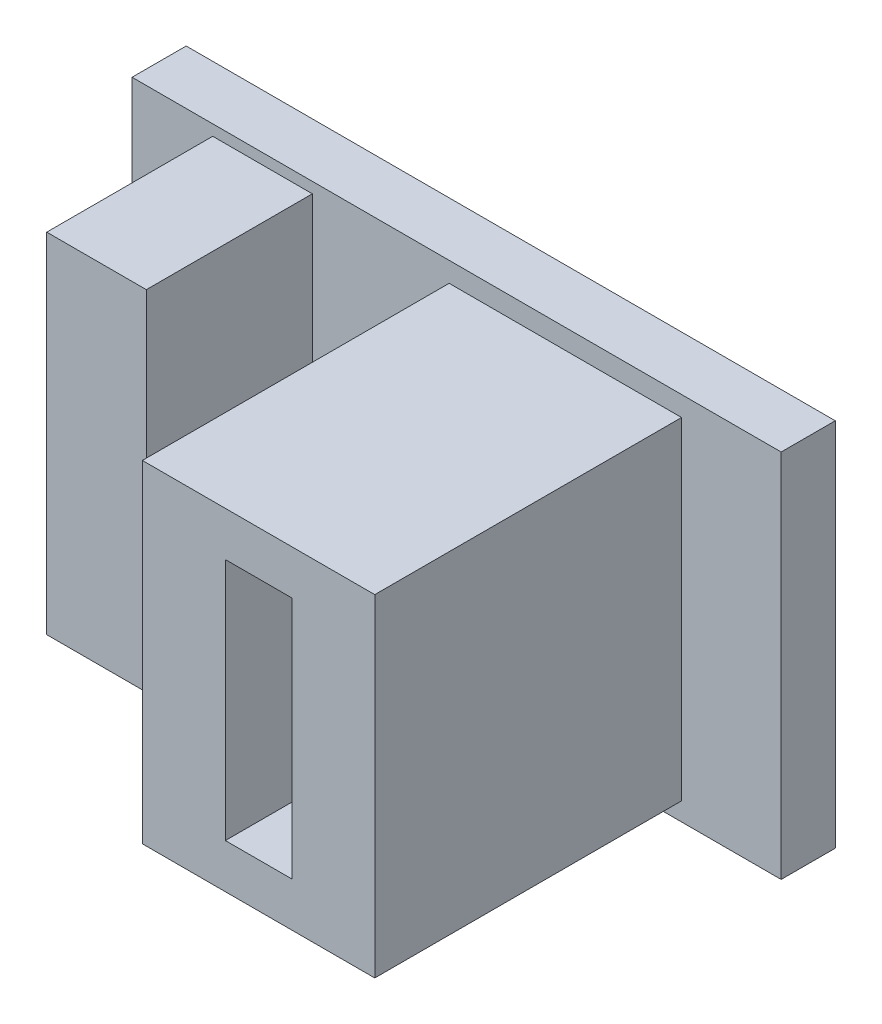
from build123d import *

# Parameters (mm, degrees)
SKETCH1_W          = 19.55
SKETCH1_H          = 11.15
EXTRUDE1_DEPTH     = 1.63
SKETCH2_W          = 7
SKETCH2_H          = 10
EXTRUDE2_DEPTH     = 9.24
SKETCH3_W          = 2
SKETCH3_H          = 7.33
CUT_EXTRUDE1_DEPTH = 8.38
SKETCH4_W          = 3
SKETCH4_H          = 10.5
EXTRUDE3_DEPTH     = 5


with BuildPart() as part:
    # Sketch1 → Extrude1 (new body)
    with BuildSketch(Plane.XY):
        with Locations((9.775, 5.575)):
            Rectangle(SKETCH1_W, SKETCH1_H)
    extrude(amount=EXTRUDE1_DEPTH)

    # Sketch2 → Extrude2 (add)
    with BuildSketch(Plane.XY.offset(1.63)):
        with Locations((13.05, 5.55)):
            Rectangle(SKETCH2_W, SKETCH2_H)
    extrude(amount=EXTRUDE2_DEPTH)

    # Sketch3 → Cut-Extrude1 (cut)
    with BuildSketch(Plane.XY.offset(10.87)):
        with Locations((13.05, 5.55)):
            Rectangle(SKETCH3_W, SKETCH3_H)
    extrude(amount=-CUT_EXTRUDE1_DEPTH, mode=Mode.SUBTRACT)

    # Sketch4 → Extrude3 (add)
    with BuildSketch(Plane.XY.offset(1.63)):
        with Locations((3.93, 5.575)):
            Rectangle(SKETCH4_W, SKETCH4_H)
    extrude(amount=EXTRUDE3_DEPTH)


solid = part.part
